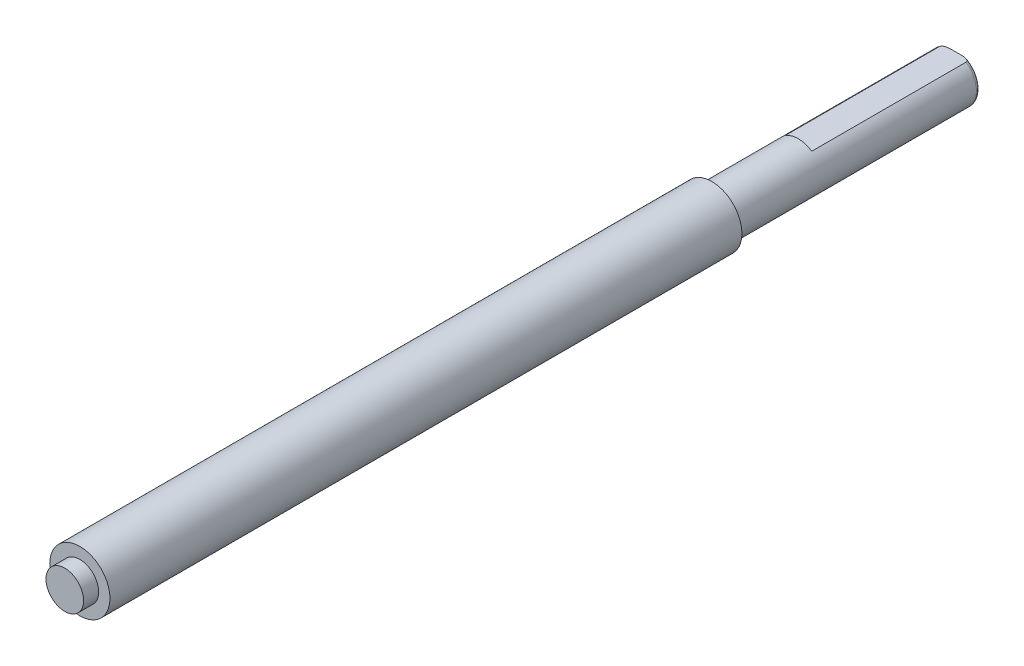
from build123d import *

# Parameters (mm, degrees)
SKETCH_2_R          = 3.175
EXTRUDE_1_DEPTH     = 32.5
SKETCH_3_R          = 4
EXTRUDE_2_DEPTH     = 84
CUT_EXTRUDE_1_DEPTH = 21
FILLET_1_R          = 0.5
SKETCH_5_R          = 2.5
EXTRUDE_3_DEPTH     = 2


with BuildPart() as part:
    # Sketch 2 → Extrude 1 (new body)
    with BuildSketch(Plane.XY):
        Circle(SKETCH_2_R)
    extrude(amount=EXTRUDE_1_DEPTH)

    # Sketch 3 → Extrude 2 (add)
    with BuildSketch(Plane.XY.offset(32.5)):
        with Locations(Location((0, 0, 0), (0, 0, 180))):
            Circle(SKETCH_3_R)
    extrude(amount=EXTRUDE_2_DEPTH)

    # Sketch 4 → Cut-Extrude 1 (cut)
    with BuildSketch(Plane(origin=(0, 0, 0), x_dir=(-1, 0, 0), z_dir=(0, 0, -1))):
        with BuildLine():
            Line((-1.78605711, 2.625), (1.78605711, 2.625))
            ThreePointArc((1.78605711, 2.625), (0, 3.175), (-1.78605711, 2.625))
        make_face()
    extrude(amount=-CUT_EXTRUDE_1_DEPTH, mode=Mode.SUBTRACT)

    # Fillet 1
    fillet_1_edges = [part.edges().sort_by_distance(p)[0] for p in [
        (-1.48490634, -2.806363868, 0),
    ]]
    fillet(fillet_1_edges, radius=FILLET_1_R)

    # Sketch 5 → Extrude 3 (add)
    with BuildSketch(Plane.XY.offset(116.5)):
        Circle(SKETCH_5_R)
    extrude(amount=EXTRUDE_3_DEPTH)


solid = part.part
